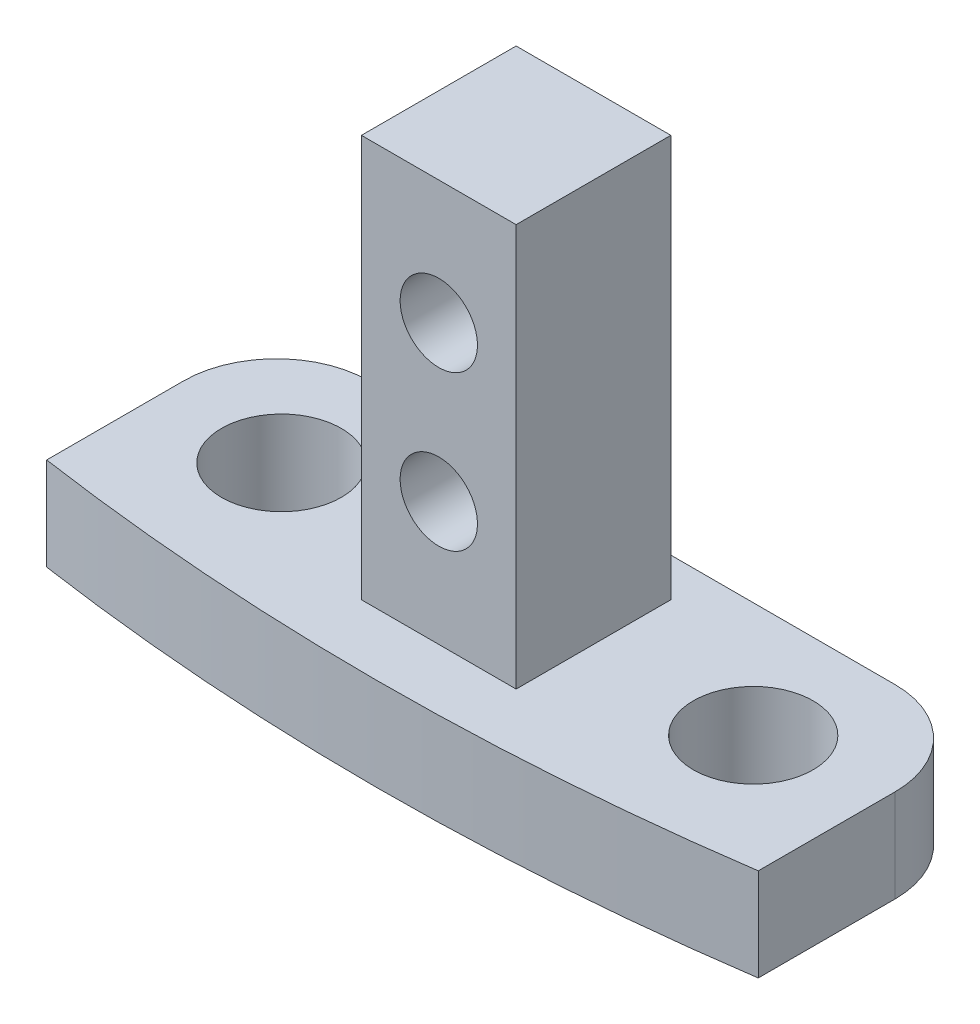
ISO-10303-21;
HEADER;
FILE_DESCRIPTION(('STEP AP214'),'2;1');
FILE_NAME('part.step','',(''),(''),'','','');
FILE_SCHEMA(('AUTOMOTIVE_DESIGN { 1 0 10303 214 1 1 1 1 }'));
ENDSEC;
DATA;
#1=APPLICATION_CONTEXT('core data for automotive mechanical design processes');
#2=APPLICATION_PROTOCOL_DEFINITION('international standard','automotive_design',2000,#1);
#3=PRODUCT_CONTEXT('',#1,'mechanical');
#4=PRODUCT('Part','Part','',(#3));
#5=PRODUCT_RELATED_PRODUCT_CATEGORY('part','',(#4));
#6=PRODUCT_DEFINITION_FORMATION('','',#4);
#7=PRODUCT_DEFINITION_CONTEXT('part definition',#1,'design');
#8=PRODUCT_DEFINITION('design','',#6,#7);
#9=PRODUCT_DEFINITION_SHAPE('','',#8);
#10=(LENGTH_UNIT() NAMED_UNIT(*) SI_UNIT(.MILLI.,.METRE.));
#11=(NAMED_UNIT(*) PLANE_ANGLE_UNIT() SI_UNIT($,.RADIAN.));
#12=(NAMED_UNIT(*) SI_UNIT($,.STERADIAN.) SOLID_ANGLE_UNIT());
#13=UNCERTAINTY_MEASURE_WITH_UNIT(LENGTH_MEASURE(1.E-05),#10,'distance_accuracy_value','');
#14=(GEOMETRIC_REPRESENTATION_CONTEXT(3) GLOBAL_UNCERTAINTY_ASSIGNED_CONTEXT((#13)) GLOBAL_UNIT_ASSIGNED_CONTEXT((#10,
#11,#12)) REPRESENTATION_CONTEXT('',''));
#15=CARTESIAN_POINT('',(0.,0.,0.));
#16=DIRECTION('',(0.,0.,1.));
#17=DIRECTION('',(1.,0.,0.));
#18=AXIS2_PLACEMENT_3D('',#15,#16,#17);
#19=CARTESIAN_POINT('',(0.,3.81,-79.1345216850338));
#20=DIRECTION('',(0.,-1.,0.));
#21=DIRECTION('',(0.,0.,-1.));
#22=AXIS2_PLACEMENT_3D('',#19,#20,#21);
#23=PLANE('',#22);
#24=CARTESIAN_POINT('',(9.68375,3.81,16.0671853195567));
#25=DIRECTION('',(0.,1.,0.));
#26=DIRECTION('',(0.,0.,1.));
#27=AXIS2_PLACEMENT_3D('',#24,#25,#26);
#28=CIRCLE('',#27,2.45744999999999);
#29=CARTESIAN_POINT('',(9.68375,3.81,18.5246353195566));
#30=VERTEX_POINT('',#29);
#31=EDGE_CURVE('E172',#30,#30,#28,.T.);
#32=ORIENTED_EDGE('',*,*,#31,.F.);
#33=EDGE_LOOP('',(#32));
#34=FACE_BOUND('',#33,.T.);
#35=CARTESIAN_POINT('',(-9.68375,3.81,16.0671853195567));
#36=DIRECTION('',(0.,1.,0.));
#37=DIRECTION('',(0.,0.,1.));
#38=AXIS2_PLACEMENT_3D('',#35,#36,#37);
#39=CIRCLE('',#38,2.45744999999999);
#40=CARTESIAN_POINT('',(-9.68375,3.81,18.5246353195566));
#41=VERTEX_POINT('',#40);
#42=EDGE_CURVE('E371',#41,#41,#39,.T.);
#43=ORIENTED_EDGE('',*,*,#42,.F.);
#44=EDGE_LOOP('',(#43));
#45=FACE_BOUND('',#44,.T.);
#46=DIRECTION('',(-1.,0.,0.));
#47=VECTOR('',#46,1.);
#48=CARTESIAN_POINT('',(-14.605,3.81,11.3529783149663));
#49=LINE('',#48,#47);
#50=CARTESIAN_POINT('',(10.795,3.81,11.3529783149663));
#51=VERTEX_POINT('',#50);
#52=CARTESIAN_POINT('',(-10.795,3.81,11.3529783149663));
#53=VERTEX_POINT('',#52);
#54=EDGE_CURVE('E154',#51,#53,#49,.T.);
#55=ORIENTED_EDGE('',*,*,#54,.T.);
#56=CARTESIAN_POINT('',(-10.795,3.81,15.1629783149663));
#57=DIRECTION('',(0.,-1.,0.));
#58=DIRECTION('',(0.,0.,-1.));
#59=AXIS2_PLACEMENT_3D('',#56,#57,#58);
#60=CIRCLE('',#59,3.81);
#61=CARTESIAN_POINT('',(-14.605,3.81,15.1629783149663));
#62=VERTEX_POINT('',#61);
#63=EDGE_CURVE('E44',#53,#62,#60,.F.);
#64=ORIENTED_EDGE('',*,*,#63,.T.);
#65=DIRECTION('',(0.,0.,1.));
#66=VECTOR('',#65,1.);
#67=CARTESIAN_POINT('',(-14.605,3.81,20.781392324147));
#68=LINE('',#67,#66);
#69=CARTESIAN_POINT('',(-14.605,3.81,20.781392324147));
#70=VERTEX_POINT('',#69);
#71=EDGE_CURVE('E156',#62,#70,#68,.T.);
#72=ORIENTED_EDGE('',*,*,#71,.T.);
#73=CARTESIAN_POINT('',(0.,3.81,-79.1345216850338));
#74=DIRECTION('',(0.,1.,0.));
#75=DIRECTION('',(0.,0.,-1.));
#76=AXIS2_PLACEMENT_3D('',#73,#74,#75);
#77=CIRCLE('',#76,100.9777);
#78=CARTESIAN_POINT('',(14.605,3.81,20.781392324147));
#79=VERTEX_POINT('',#78);
#80=EDGE_CURVE('E148',#70,#79,#77,.T.);
#81=ORIENTED_EDGE('',*,*,#80,.T.);
#82=DIRECTION('',(0.,0.,-1.));
#83=VECTOR('',#82,1.);
#84=CARTESIAN_POINT('',(14.605,3.81,11.3529783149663));
#85=LINE('',#84,#83);
#86=CARTESIAN_POINT('',(14.605,3.81,15.1629783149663));
#87=VERTEX_POINT('',#86);
#88=EDGE_CURVE('E151',#79,#87,#85,.T.);
#89=ORIENTED_EDGE('',*,*,#88,.T.);
#90=CARTESIAN_POINT('',(10.795,3.81,15.1629783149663));
#91=DIRECTION('',(0.,-1.,0.));
#92=DIRECTION('',(0.,0.,-1.));
#93=AXIS2_PLACEMENT_3D('',#90,#91,#92);
#94=CIRCLE('',#93,3.81);
#95=EDGE_CURVE('E188',#87,#51,#94,.F.);
#96=ORIENTED_EDGE('',*,*,#95,.T.);
#97=EDGE_LOOP('',(#55,#64,#72,#81,#89,#96));
#98=FACE_BOUND('',#97,.T.);
#99=DIRECTION('',(0.,0.,-1.));
#100=VECTOR('',#99,1.);
#101=CARTESIAN_POINT('',(3.175,3.81,19.2904783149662));
#102=LINE('',#101,#100);
#103=CARTESIAN_POINT('',(3.175,3.81,19.2904783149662));
#104=VERTEX_POINT('',#103);
#105=CARTESIAN_POINT('',(3.175,3.81,12.9404783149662));
#106=VERTEX_POINT('',#105);
#107=EDGE_CURVE('E138',#104,#106,#102,.T.);
#108=ORIENTED_EDGE('',*,*,#107,.F.);
#109=DIRECTION('',(1.,0.,0.));
#110=VECTOR('',#109,1.);
#111=CARTESIAN_POINT('',(-3.175,3.81,19.2904783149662));
#112=LINE('',#111,#110);
#113=CARTESIAN_POINT('',(-3.175,3.81,19.2904783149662));
#114=VERTEX_POINT('',#113);
#115=EDGE_CURVE('E135',#114,#104,#112,.T.);
#116=ORIENTED_EDGE('',*,*,#115,.F.);
#117=DIRECTION('',(0.,0.,1.));
#118=VECTOR('',#117,1.);
#119=CARTESIAN_POINT('',(-3.175,3.81,19.2904783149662));
#120=LINE('',#119,#118);
#121=CARTESIAN_POINT('',(-3.175,3.81,12.9404783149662));
#122=VERTEX_POINT('',#121);
#123=EDGE_CURVE('E383',#122,#114,#120,.T.);
#124=ORIENTED_EDGE('',*,*,#123,.F.);
#125=DIRECTION('',(-1.,0.,0.));
#126=VECTOR('',#125,1.);
#127=CARTESIAN_POINT('',(-3.175,3.81,12.9404783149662));
#128=LINE('',#127,#126);
#129=EDGE_CURVE('E373',#106,#122,#128,.T.);
#130=ORIENTED_EDGE('',*,*,#129,.F.);
#131=EDGE_LOOP('',(#108,#116,#124,#130));
#132=FACE_BOUND('',#131,.T.);
#133=ADVANCED_FACE('F36',(#34,#45,#98,#132),#23,.F.);
#134=CARTESIAN_POINT('',(0.,3.81,-79.1345216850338));
#135=DIRECTION('',(0.,-1.,0.));
#136=DIRECTION('',(0.,0.,-1.));
#137=AXIS2_PLACEMENT_3D('',#134,#135,#136);
#138=CYLINDRICAL_SURFACE('',#137,100.9777);
#139=CARTESIAN_POINT('',(0.,0.,-79.1345216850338));
#140=DIRECTION('',(0.,1.,0.));
#141=DIRECTION('',(0.,0.,-1.));
#142=AXIS2_PLACEMENT_3D('',#139,#140,#141);
#143=CIRCLE('',#142,100.9777);
#144=CARTESIAN_POINT('',(-14.605,0.,20.781392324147));
#145=VERTEX_POINT('',#144);
#146=CARTESIAN_POINT('',(14.605,0.,20.781392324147));
#147=VERTEX_POINT('',#146);
#148=EDGE_CURVE('E139',#145,#147,#143,.T.);
#149=ORIENTED_EDGE('',*,*,#148,.T.);
#150=DIRECTION('',(0.,-1.,0.));
#151=VECTOR('',#150,1.);
#152=CARTESIAN_POINT('',(14.605,3.81,20.781392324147));
#153=LINE('',#152,#151);
#154=EDGE_CURVE('E165',#79,#147,#153,.T.);
#155=ORIENTED_EDGE('',*,*,#154,.F.);
#156=ORIENTED_EDGE('',*,*,#80,.F.);
#157=DIRECTION('',(0.,-1.,0.));
#158=VECTOR('',#157,1.);
#159=CARTESIAN_POINT('',(-14.605,3.81,20.781392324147));
#160=LINE('',#159,#158);
#161=EDGE_CURVE('E157',#70,#145,#160,.T.);
#162=ORIENTED_EDGE('',*,*,#161,.T.);
#163=EDGE_LOOP('',(#149,#155,#156,#162));
#164=FACE_BOUND('',#163,.T.);
#165=ADVANCED_FACE('F212',(#164),#138,.T.);
#166=CARTESIAN_POINT('',(14.605,3.81,11.3529783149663));
#167=DIRECTION('',(-1.,0.,0.));
#168=DIRECTION('',(0.,0.,1.));
#169=AXIS2_PLACEMENT_3D('',#166,#167,#168);
#170=PLANE('',#169);
#171=DIRECTION('',(0.,0.,-1.));
#172=VECTOR('',#171,1.);
#173=CARTESIAN_POINT('',(14.605,0.,11.3529783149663));
#174=LINE('',#173,#172);
#175=CARTESIAN_POINT('',(14.605,0.,15.1629783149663));
#176=VERTEX_POINT('',#175);
#177=EDGE_CURVE('E142',#147,#176,#174,.T.);
#178=ORIENTED_EDGE('',*,*,#177,.T.);
#179=DIRECTION('',(0.,-1.,0.));
#180=VECTOR('',#179,1.);
#181=CARTESIAN_POINT('',(14.605,3.81,15.1629783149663));
#182=LINE('',#181,#180);
#183=EDGE_CURVE('E11',#176,#87,#182,.F.);
#184=ORIENTED_EDGE('',*,*,#183,.T.);
#185=ORIENTED_EDGE('',*,*,#88,.F.);
#186=ORIENTED_EDGE('',*,*,#154,.T.);
#187=EDGE_LOOP('',(#178,#184,#185,#186));
#188=FACE_BOUND('',#187,.T.);
#189=ADVANCED_FACE('F209',(#188),#170,.F.);
#190=CARTESIAN_POINT('',(-14.605,3.81,11.3529783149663));
#191=DIRECTION('',(0.,0.,1.));
#192=DIRECTION('',(1.,0.,0.));
#193=AXIS2_PLACEMENT_3D('',#190,#191,#192);
#194=PLANE('',#193);
#195=DIRECTION('',(-1.,0.,0.));
#196=VECTOR('',#195,1.);
#197=CARTESIAN_POINT('',(-14.605,0.,11.3529783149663));
#198=LINE('',#197,#196);
#199=CARTESIAN_POINT('',(10.795,0.,11.3529783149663));
#200=VERTEX_POINT('',#199);
#201=CARTESIAN_POINT('',(-10.795,0.,11.3529783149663));
#202=VERTEX_POINT('',#201);
#203=EDGE_CURVE('E160',#200,#202,#198,.T.);
#204=ORIENTED_EDGE('',*,*,#203,.T.);
#205=DIRECTION('',(0.,-1.,0.));
#206=VECTOR('',#205,1.);
#207=CARTESIAN_POINT('',(-10.795,3.81,11.3529783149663));
#208=LINE('',#207,#206);
#209=EDGE_CURVE('E57',#202,#53,#208,.F.);
#210=ORIENTED_EDGE('',*,*,#209,.T.);
#211=ORIENTED_EDGE('',*,*,#54,.F.);
#212=DIRECTION('',(0.,-1.,0.));
#213=VECTOR('',#212,1.);
#214=CARTESIAN_POINT('',(10.795,3.81,11.3529783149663));
#215=LINE('',#214,#213);
#216=EDGE_CURVE('E184',#51,#200,#215,.T.);
#217=ORIENTED_EDGE('',*,*,#216,.T.);
#218=EDGE_LOOP('',(#204,#210,#211,#217));
#219=FACE_BOUND('',#218,.T.);
#220=ADVANCED_FACE('F205',(#219),#194,.F.);
#221=CARTESIAN_POINT('',(-14.605,3.81,20.781392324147));
#222=DIRECTION('',(1.,0.,0.));
#223=DIRECTION('',(0.,0.,-1.));
#224=AXIS2_PLACEMENT_3D('',#221,#222,#223);
#225=PLANE('',#224);
#226=ORIENTED_EDGE('',*,*,#71,.F.);
#227=DIRECTION('',(0.,-1.,0.));
#228=VECTOR('',#227,1.);
#229=CARTESIAN_POINT('',(-14.605,3.81,15.1629783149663));
#230=LINE('',#229,#228);
#231=CARTESIAN_POINT('',(-14.605,0.,15.1629783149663));
#232=VERTEX_POINT('',#231);
#233=EDGE_CURVE('E168',#62,#232,#230,.T.);
#234=ORIENTED_EDGE('',*,*,#233,.T.);
#235=DIRECTION('',(0.,0.,1.));
#236=VECTOR('',#235,1.);
#237=CARTESIAN_POINT('',(-14.605,0.,20.781392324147));
#238=LINE('',#237,#236);
#239=EDGE_CURVE('E152',#232,#145,#238,.T.);
#240=ORIENTED_EDGE('',*,*,#239,.T.);
#241=ORIENTED_EDGE('',*,*,#161,.F.);
#242=EDGE_LOOP('',(#226,#234,#240,#241));
#243=FACE_BOUND('',#242,.T.);
#244=ADVANCED_FACE('F197',(#243),#225,.F.);
#245=CARTESIAN_POINT('',(0.,0.,-79.1345216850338));
#246=DIRECTION('',(0.,-1.,0.));
#247=DIRECTION('',(0.,0.,-1.));
#248=AXIS2_PLACEMENT_3D('',#245,#246,#247);
#249=PLANE('',#248);
#250=CARTESIAN_POINT('',(9.68375,0.,16.0671853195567));
#251=DIRECTION('',(0.,1.,0.));
#252=DIRECTION('',(0.,0.,1.));
#253=AXIS2_PLACEMENT_3D('',#250,#251,#252);
#254=CIRCLE('',#253,2.45745);
#255=CARTESIAN_POINT('',(9.68375,0.,18.5246353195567));
#256=VERTEX_POINT('',#255);
#257=EDGE_CURVE('E367',#256,#256,#254,.T.);
#258=ORIENTED_EDGE('',*,*,#257,.T.);
#259=EDGE_LOOP('',(#258));
#260=FACE_BOUND('',#259,.T.);
#261=CARTESIAN_POINT('',(-9.68375,0.,16.0671853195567));
#262=DIRECTION('',(0.,1.,0.));
#263=DIRECTION('',(0.,0.,1.));
#264=AXIS2_PLACEMENT_3D('',#261,#262,#263);
#265=CIRCLE('',#264,2.45745);
#266=CARTESIAN_POINT('',(-9.68375,0.,18.5246353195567));
#267=VERTEX_POINT('',#266);
#268=EDGE_CURVE('E370',#267,#267,#265,.T.);
#269=ORIENTED_EDGE('',*,*,#268,.T.);
#270=EDGE_LOOP('',(#269));
#271=FACE_BOUND('',#270,.T.);
#272=ORIENTED_EDGE('',*,*,#239,.F.);
#273=CARTESIAN_POINT('',(-10.795,0.,15.1629783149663));
#274=DIRECTION('',(0.,-1.,0.));
#275=DIRECTION('',(0.,0.,-1.));
#276=AXIS2_PLACEMENT_3D('',#273,#274,#275);
#277=CIRCLE('',#276,3.81);
#278=EDGE_CURVE('E182',#232,#202,#277,.T.);
#279=ORIENTED_EDGE('',*,*,#278,.T.);
#280=ORIENTED_EDGE('',*,*,#203,.F.);
#281=CARTESIAN_POINT('',(10.795,0.,15.1629783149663));
#282=DIRECTION('',(0.,-1.,0.));
#283=DIRECTION('',(0.,0.,-1.));
#284=AXIS2_PLACEMENT_3D('',#281,#282,#283);
#285=CIRCLE('',#284,3.81);
#286=EDGE_CURVE('E180',#200,#176,#285,.T.);
#287=ORIENTED_EDGE('',*,*,#286,.T.);
#288=ORIENTED_EDGE('',*,*,#177,.F.);
#289=ORIENTED_EDGE('',*,*,#148,.F.);
#290=EDGE_LOOP('',(#272,#279,#280,#287,#288,#289));
#291=FACE_BOUND('',#290,.T.);
#292=ADVANCED_FACE('F203',(#260,#271,#291),#249,.T.);
#293=CARTESIAN_POINT('',(3.175,20.32,19.2904783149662));
#294=DIRECTION('',(-1.,0.,0.));
#295=DIRECTION('',(0.,0.,1.));
#296=AXIS2_PLACEMENT_3D('',#293,#294,#295);
#297=PLANE('',#296);
#298=ORIENTED_EDGE('',*,*,#107,.T.);
#299=DIRECTION('',(0.,-1.,0.));
#300=VECTOR('',#299,1.);
#301=CARTESIAN_POINT('',(3.175,20.32,12.9404783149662));
#302=LINE('',#301,#300);
#303=CARTESIAN_POINT('',(3.175,20.32,12.9404783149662));
#304=VERTEX_POINT('',#303);
#305=EDGE_CURVE('E119',#304,#106,#302,.T.);
#306=ORIENTED_EDGE('',*,*,#305,.F.);
#307=DIRECTION('',(0.,0.,-1.));
#308=VECTOR('',#307,1.);
#309=CARTESIAN_POINT('',(3.175,20.32,19.2904783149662));
#310=LINE('',#309,#308);
#311=CARTESIAN_POINT('',(3.175,20.32,19.2904783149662));
#312=VERTEX_POINT('',#311);
#313=EDGE_CURVE('E126',#312,#304,#310,.T.);
#314=ORIENTED_EDGE('',*,*,#313,.F.);
#315=DIRECTION('',(0.,-1.,0.));
#316=VECTOR('',#315,1.);
#317=CARTESIAN_POINT('',(3.175,20.32,19.2904783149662));
#318=LINE('',#317,#316);
#319=EDGE_CURVE('E380',#312,#104,#318,.T.);
#320=ORIENTED_EDGE('',*,*,#319,.T.);
#321=EDGE_LOOP('',(#298,#306,#314,#320));
#322=FACE_BOUND('',#321,.T.);
#323=ADVANCED_FACE('F137',(#322),#297,.F.);
#324=CARTESIAN_POINT('',(-3.175,20.32,12.9404783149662));
#325=DIRECTION('',(0.,0.,1.));
#326=DIRECTION('',(1.,0.,0.));
#327=AXIS2_PLACEMENT_3D('',#324,#325,#326);
#328=PLANE('',#327);
#329=CARTESIAN_POINT('',(0.,15.24,12.9404783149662));
#330=DIRECTION('',(0.,0.,-1.));
#331=DIRECTION('',(-1.,0.,0.));
#332=AXIS2_PLACEMENT_3D('',#329,#330,#331);
#333=CIRCLE('',#332,1.5875);
#334=CARTESIAN_POINT('',(-1.5875,15.24,12.9404783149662));
#335=VERTEX_POINT('',#334);
#336=EDGE_CURVE('E177',#335,#335,#333,.T.);
#337=ORIENTED_EDGE('',*,*,#336,.F.);
#338=EDGE_LOOP('',(#337));
#339=FACE_BOUND('',#338,.T.);
#340=CARTESIAN_POINT('',(0.,8.89,12.9404783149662));
#341=DIRECTION('',(0.,0.,-1.));
#342=DIRECTION('',(-1.,0.,0.));
#343=AXIS2_PLACEMENT_3D('',#340,#341,#342);
#344=CIRCLE('',#343,1.5875);
#345=CARTESIAN_POINT('',(-1.5875,8.89,12.9404783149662));
#346=VERTEX_POINT('',#345);
#347=EDGE_CURVE('E173',#346,#346,#344,.T.);
#348=ORIENTED_EDGE('',*,*,#347,.F.);
#349=EDGE_LOOP('',(#348));
#350=FACE_BOUND('',#349,.T.);
#351=ORIENTED_EDGE('',*,*,#129,.T.);
#352=DIRECTION('',(0.,-1.,0.));
#353=VECTOR('',#352,1.);
#354=CARTESIAN_POINT('',(-3.175,20.32,12.9404783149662));
#355=LINE('',#354,#353);
#356=CARTESIAN_POINT('',(-3.175,20.32,12.9404783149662));
#357=VERTEX_POINT('',#356);
#358=EDGE_CURVE('E122',#357,#122,#355,.T.);
#359=ORIENTED_EDGE('',*,*,#358,.F.);
#360=DIRECTION('',(-1.,0.,0.));
#361=VECTOR('',#360,1.);
#362=CARTESIAN_POINT('',(-3.175,20.32,12.9404783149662));
#363=LINE('',#362,#361);
#364=EDGE_CURVE('E114',#304,#357,#363,.T.);
#365=ORIENTED_EDGE('',*,*,#364,.F.);
#366=ORIENTED_EDGE('',*,*,#305,.T.);
#367=EDGE_LOOP('',(#351,#359,#365,#366));
#368=FACE_BOUND('',#367,.T.);
#369=ADVANCED_FACE('F117',(#339,#350,#368),#328,.F.);
#370=CARTESIAN_POINT('',(-3.175,20.32,19.2904783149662));
#371=DIRECTION('',(1.,0.,0.));
#372=DIRECTION('',(0.,0.,-1.));
#373=AXIS2_PLACEMENT_3D('',#370,#371,#372);
#374=PLANE('',#373);
#375=ORIENTED_EDGE('',*,*,#123,.T.);
#376=DIRECTION('',(0.,-1.,0.));
#377=VECTOR('',#376,1.);
#378=CARTESIAN_POINT('',(-3.175,20.32,19.2904783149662));
#379=LINE('',#378,#377);
#380=CARTESIAN_POINT('',(-3.175,20.32,19.2904783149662));
#381=VERTEX_POINT('',#380);
#382=EDGE_CURVE('E144',#381,#114,#379,.T.);
#383=ORIENTED_EDGE('',*,*,#382,.F.);
#384=DIRECTION('',(0.,0.,1.));
#385=VECTOR('',#384,1.);
#386=CARTESIAN_POINT('',(-3.175,20.32,19.2904783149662));
#387=LINE('',#386,#385);
#388=EDGE_CURVE('E125',#357,#381,#387,.T.);
#389=ORIENTED_EDGE('',*,*,#388,.F.);
#390=ORIENTED_EDGE('',*,*,#358,.T.);
#391=EDGE_LOOP('',(#375,#383,#389,#390));
#392=FACE_BOUND('',#391,.T.);
#393=ADVANCED_FACE('F253',(#392),#374,.F.);
#394=CARTESIAN_POINT('',(-3.175,20.32,19.2904783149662));
#395=DIRECTION('',(0.,0.,-1.));
#396=DIRECTION('',(-1.,0.,0.));
#397=AXIS2_PLACEMENT_3D('',#394,#395,#396);
#398=PLANE('',#397);
#399=CARTESIAN_POINT('',(0.,15.24,19.2904783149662));
#400=DIRECTION('',(0.,0.,-1.));
#401=DIRECTION('',(-1.,0.,0.));
#402=AXIS2_PLACEMENT_3D('',#399,#400,#401);
#403=CIRCLE('',#402,1.5875);
#404=CARTESIAN_POINT('',(-1.5875,15.24,19.2904783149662));
#405=VERTEX_POINT('',#404);
#406=EDGE_CURVE('E174',#405,#405,#403,.T.);
#407=ORIENTED_EDGE('',*,*,#406,.T.);
#408=EDGE_LOOP('',(#407));
#409=FACE_BOUND('',#408,.T.);
#410=CARTESIAN_POINT('',(0.,8.89,19.2904783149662));
#411=DIRECTION('',(0.,0.,-1.));
#412=DIRECTION('',(-1.,0.,0.));
#413=AXIS2_PLACEMENT_3D('',#410,#411,#412);
#414=CIRCLE('',#413,1.5875);
#415=CARTESIAN_POINT('',(-1.5875,8.89,19.2904783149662));
#416=VERTEX_POINT('',#415);
#417=EDGE_CURVE('E169',#416,#416,#414,.T.);
#418=ORIENTED_EDGE('',*,*,#417,.T.);
#419=EDGE_LOOP('',(#418));
#420=FACE_BOUND('',#419,.T.);
#421=ORIENTED_EDGE('',*,*,#115,.T.);
#422=ORIENTED_EDGE('',*,*,#319,.F.);
#423=DIRECTION('',(1.,0.,0.));
#424=VECTOR('',#423,1.);
#425=CARTESIAN_POINT('',(-3.175,20.32,19.2904783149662));
#426=LINE('',#425,#424);
#427=EDGE_CURVE('E131',#381,#312,#426,.T.);
#428=ORIENTED_EDGE('',*,*,#427,.F.);
#429=ORIENTED_EDGE('',*,*,#382,.T.);
#430=EDGE_LOOP('',(#421,#422,#428,#429));
#431=FACE_BOUND('',#430,.T.);
#432=ADVANCED_FACE('F250',(#409,#420,#431),#398,.F.);
#433=CARTESIAN_POINT('',(0.,20.32,0.));
#434=DIRECTION('',(0.,-1.,0.));
#435=DIRECTION('',(0.,0.,-1.));
#436=AXIS2_PLACEMENT_3D('',#433,#434,#435);
#437=PLANE('',#436);
#438=ORIENTED_EDGE('',*,*,#313,.T.);
#439=ORIENTED_EDGE('',*,*,#364,.T.);
#440=ORIENTED_EDGE('',*,*,#388,.T.);
#441=ORIENTED_EDGE('',*,*,#427,.T.);
#442=EDGE_LOOP('',(#438,#439,#440,#441));
#443=FACE_BOUND('',#442,.T.);
#444=ADVANCED_FACE('F129',(#443),#437,.F.);
#445=CARTESIAN_POINT('',(-9.68375,3.81,16.0671853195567));
#446=DIRECTION('',(0.,1.,0.));
#447=DIRECTION('',(0.,0.,1.));
#448=AXIS2_PLACEMENT_3D('',#445,#446,#447);
#449=CYLINDRICAL_SURFACE('',#448,2.45744999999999);
#450=ORIENTED_EDGE('',*,*,#268,.F.);
#451=EDGE_LOOP('',(#450));
#452=FACE_BOUND('',#451,.T.);
#453=ORIENTED_EDGE('',*,*,#42,.T.);
#454=EDGE_LOOP('',(#453));
#455=FACE_BOUND('',#454,.T.);
#456=ADVANCED_FACE('F243',(#452,#455),#449,.F.);
#457=CARTESIAN_POINT('',(9.68375,3.81,16.0671853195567));
#458=DIRECTION('',(0.,1.,0.));
#459=DIRECTION('',(0.,0.,1.));
#460=AXIS2_PLACEMENT_3D('',#457,#458,#459);
#461=CYLINDRICAL_SURFACE('',#460,2.45744999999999);
#462=ORIENTED_EDGE('',*,*,#257,.F.);
#463=EDGE_LOOP('',(#462));
#464=FACE_BOUND('',#463,.T.);
#465=ORIENTED_EDGE('',*,*,#31,.T.);
#466=EDGE_LOOP('',(#465));
#467=FACE_BOUND('',#466,.T.);
#468=ADVANCED_FACE('F235',(#464,#467),#461,.F.);
#469=CARTESIAN_POINT('',(0.,8.89,12.9404783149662));
#470=DIRECTION('',(0.,0.,-1.));
#471=DIRECTION('',(-1.,0.,0.));
#472=AXIS2_PLACEMENT_3D('',#469,#470,#471);
#473=CYLINDRICAL_SURFACE('',#472,1.5875);
#474=ORIENTED_EDGE('',*,*,#347,.T.);
#475=EDGE_LOOP('',(#474));
#476=FACE_BOUND('',#475,.T.);
#477=ORIENTED_EDGE('',*,*,#417,.F.);
#478=EDGE_LOOP('',(#477));
#479=FACE_BOUND('',#478,.T.);
#480=ADVANCED_FACE('F229',(#476,#479),#473,.F.);
#481=CARTESIAN_POINT('',(0.,15.24,12.9404783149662));
#482=DIRECTION('',(0.,0.,-1.));
#483=DIRECTION('',(-1.,0.,0.));
#484=AXIS2_PLACEMENT_3D('',#481,#482,#483);
#485=CYLINDRICAL_SURFACE('',#484,1.5875);
#486=ORIENTED_EDGE('',*,*,#336,.T.);
#487=EDGE_LOOP('',(#486));
#488=FACE_BOUND('',#487,.T.);
#489=ORIENTED_EDGE('',*,*,#406,.F.);
#490=EDGE_LOOP('',(#489));
#491=FACE_BOUND('',#490,.T.);
#492=ADVANCED_FACE('F224',(#488,#491),#485,.F.);
#493=CARTESIAN_POINT('',(-10.795,3.81,15.1629783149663));
#494=DIRECTION('',(0.,-1.,0.));
#495=DIRECTION('',(0.,0.,-1.));
#496=AXIS2_PLACEMENT_3D('',#493,#494,#495);
#497=CYLINDRICAL_SURFACE('',#496,3.81);
#498=ORIENTED_EDGE('',*,*,#63,.F.);
#499=ORIENTED_EDGE('',*,*,#209,.F.);
#500=ORIENTED_EDGE('',*,*,#278,.F.);
#501=ORIENTED_EDGE('',*,*,#233,.F.);
#502=EDGE_LOOP('',(#498,#499,#500,#501));
#503=FACE_BOUND('',#502,.T.);
#504=ADVANCED_FACE('F200',(#503),#497,.T.);
#505=CARTESIAN_POINT('',(10.795,3.81,15.1629783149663));
#506=DIRECTION('',(0.,-1.,0.));
#507=DIRECTION('',(0.,0.,-1.));
#508=AXIS2_PLACEMENT_3D('',#505,#506,#507);
#509=CYLINDRICAL_SURFACE('',#508,3.81);
#510=ORIENTED_EDGE('',*,*,#95,.F.);
#511=ORIENTED_EDGE('',*,*,#183,.F.);
#512=ORIENTED_EDGE('',*,*,#286,.F.);
#513=ORIENTED_EDGE('',*,*,#216,.F.);
#514=EDGE_LOOP('',(#510,#511,#512,#513));
#515=FACE_BOUND('',#514,.T.);
#516=ADVANCED_FACE('F38',(#515),#509,.T.);
#517=CLOSED_SHELL('',(#133,#165,#189,#220,#244,#292,#323,#369,#393,#432,#444,#456,#468,#480,
#492,#504,#516));
#518=MANIFOLD_SOLID_BREP('B2',#517);
#519=ADVANCED_BREP_SHAPE_REPRESENTATION('',(#18,#518),#14);
#520=SHAPE_DEFINITION_REPRESENTATION(#9,#519);
ENDSEC;
END-ISO-10303-21;
